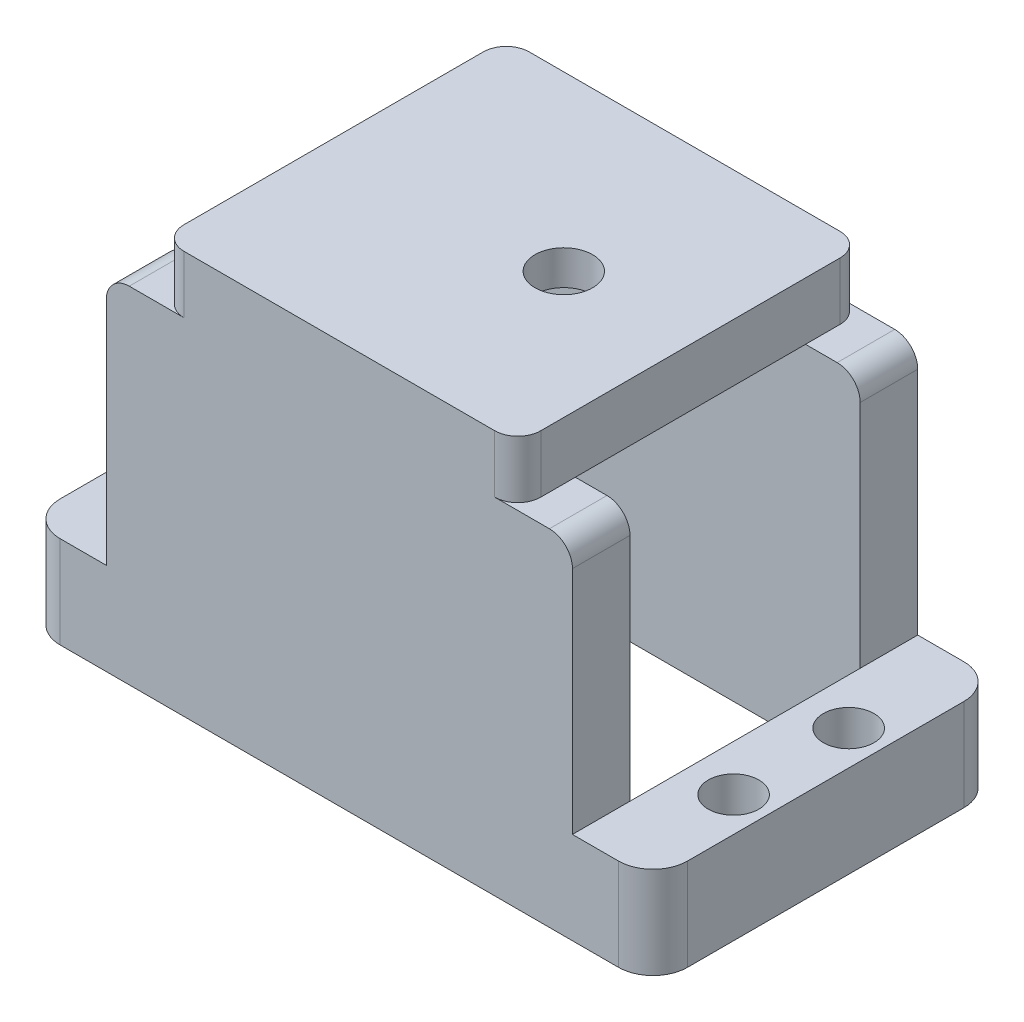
from build123d import *

# Parameters (mm, degrees)
SKIZZE1_W                       = 54.5
SKIZZE1_H                       = 30
SKIZZE1_R                       = 2.2
AUFSATZ_LINEAR_AUSTRAGEN3_DEPTH = 30
SKIZZE3_W                       = 7
SKIZZE3_H                       = 22
SCHNITT_LINEAR_AUSTRAGEN2_DEPTH = 70.06699646
SKIZZE4_W                       = 40.5
SKIZZE4_H                       = 20
SCHNITT_LINEAR_AUSTRAGEN5_DEPTH = 70.06699646
SKIZZE6_W                       = 31
SKIZZE6_H                       = 30
AUFSATZ_LINEAR_AUSTRAGEN5_DEPTH = 5
SKIZZE7_R                       = 2.500066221
SCHNITT_LINEAR_AUSTRAGEN7_DEPTH = 72.381019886
SKIZZE8_R                       = 6.1
SCHNITT_LINEAR_AUSTRAGEN8_DEPTH = 2
VERRUNDUNG1_R                   = 3
VERRUNDUNG2_R                   = 2


with BuildPart() as part:
    # Skizze1 → Aufsatz-Linear austragen3 (new body)
    with BuildSketch(Plane(origin=(0, 0, 0), x_dir=(1, 0, 0), z_dir=(0, 1, 0))):
        with Locations((27.25, -15)):
            Rectangle(SKIZZE1_W, SKIZZE1_H)
        with Locations(Location((51.5, -10, 0), (0, 0, 270))):
            Circle(SKIZZE1_R, mode=Mode.SUBTRACT)
        with Locations(Location((51.5, -20, 0), (0, 0, 90))):
            Circle(SKIZZE1_R, mode=Mode.SUBTRACT)
        with Locations(Location((3, -20, 0), (0, 0, 270))):
            Circle(SKIZZE1_R, mode=Mode.SUBTRACT)
        with Locations(Location((3, -10, 0), (0, 0, 90))):
            Circle(SKIZZE1_R, mode=Mode.SUBTRACT)
    extrude(amount=AUFSATZ_LINEAR_AUSTRAGEN3_DEPTH)

    # Skizze3 → Schnitt-Linear austragen2 (cut, through all)
    with BuildSketch(Plane.XY.offset(30)):
        with Locations((51, 19)):
            Rectangle(SKIZZE3_W, SKIZZE3_H)
        with Locations((3.5, 19)):
            Rectangle(SKIZZE3_W, SKIZZE3_H)
    extrude(amount=-SCHNITT_LINEAR_AUSTRAGEN2_DEPTH, mode=Mode.SUBTRACT)

    # Skizze4 → Schnitt-Linear austragen5 (cut, through all)
    with BuildSketch(Plane(origin=(0, 0, 0), x_dir=(-1, 0, 0), z_dir=(0, -1, 0))):
        with Locations((-27.25, -15)):
            Rectangle(SKIZZE4_W, SKIZZE4_H)
    extrude(amount=-SCHNITT_LINEAR_AUSTRAGEN5_DEPTH, mode=Mode.SUBTRACT)

    # Skizze6 → Aufsatz-Linear austragen5 (add)
    with BuildSketch(Plane(origin=(0, 30, 0), x_dir=(1, 0, 0), z_dir=(0, 1, 0))):
        with Locations((27.25, -15)):
            Rectangle(SKIZZE6_W, SKIZZE6_H)
    extrude(amount=AUFSATZ_LINEAR_AUSTRAGEN5_DEPTH)

    # Skizze7 → Schnitt-Linear austragen7 (cut, through all)
    with BuildSketch(Plane(origin=(0, 35, 0), x_dir=(1, 0, 0), z_dir=(0, 1, 0))):
        with Locations(Location((31.75, -15, 0), (0, 0, 270))):
            Circle(SKIZZE7_R)
    extrude(amount=-SCHNITT_LINEAR_AUSTRAGEN7_DEPTH, mode=Mode.SUBTRACT)

    # Skizze8 → Schnitt-Linear austragen8 (cut)
    with BuildSketch(Plane(origin=(0, 30, 0), x_dir=(-1, 0, 0), z_dir=(0, -1, 0))):
        with Locations(Location((-31.75, -15, 0), (0, 0, 90))):
            Circle(SKIZZE8_R)
    extrude(amount=-SCHNITT_LINEAR_AUSTRAGEN8_DEPTH, mode=Mode.SUBTRACT)

    # Verrundung1
    verrundung1_edges = [part.edges().sort_by_distance(p)[0] for p in [
        (0, 4, 0),
        (54.5, 4, 0),
        (54.5, 4, 30),
        (0, 4, 30),
    ]]
    fillet(verrundung1_edges, radius=VERRUNDUNG1_R)

    # Verrundung2
    verrundung2_edges = [part.edges().sort_by_distance(p)[0] for p in [
        (47.5, 30, 2.5),
        (7, 30, 2.5),
        (47.5, 30, 27.5),
        (7, 30, 27.5),
        (11.75, 32.5, 0),
        (11.75, 32.5, 30),
        (42.75, 32.5, 30),
        (42.75, 32.5, 0),
    ]]
    fillet(verrundung2_edges, radius=VERRUNDUNG2_R)


solid = part.part
